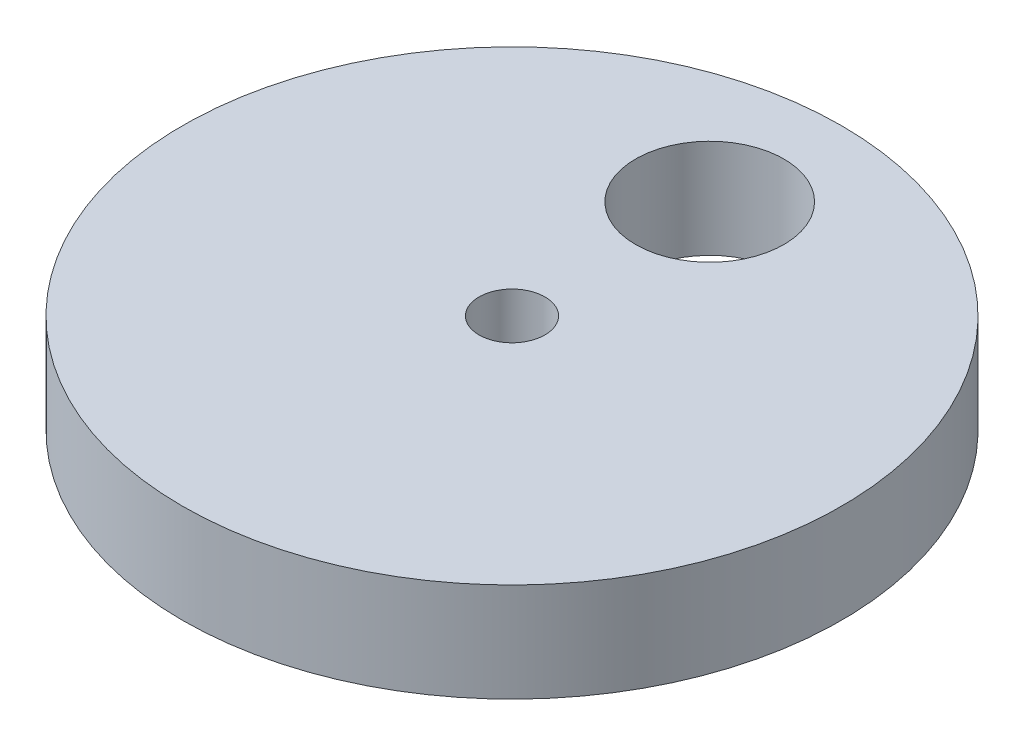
ISO-10303-21;
HEADER;
FILE_DESCRIPTION(('STEP AP214'),'2;1');
FILE_NAME('part.step','',(''),(''),'','','');
FILE_SCHEMA(('AUTOMOTIVE_DESIGN { 1 0 10303 214 1 1 1 1 }'));
ENDSEC;
DATA;
#1=APPLICATION_CONTEXT('core data for automotive mechanical design processes');
#2=APPLICATION_PROTOCOL_DEFINITION('international standard','automotive_design',2000,#1);
#3=PRODUCT_CONTEXT('',#1,'mechanical');
#4=PRODUCT('Part','Part','',(#3));
#5=PRODUCT_RELATED_PRODUCT_CATEGORY('part','',(#4));
#6=PRODUCT_DEFINITION_FORMATION('','',#4);
#7=PRODUCT_DEFINITION_CONTEXT('part definition',#1,'design');
#8=PRODUCT_DEFINITION('design','',#6,#7);
#9=PRODUCT_DEFINITION_SHAPE('','',#8);
#10=(LENGTH_UNIT() NAMED_UNIT(*) SI_UNIT(.MILLI.,.METRE.));
#11=(NAMED_UNIT(*) PLANE_ANGLE_UNIT() SI_UNIT($,.RADIAN.));
#12=(NAMED_UNIT(*) SI_UNIT($,.STERADIAN.) SOLID_ANGLE_UNIT());
#13=UNCERTAINTY_MEASURE_WITH_UNIT(LENGTH_MEASURE(1.E-05),#10,'distance_accuracy_value','');
#14=(GEOMETRIC_REPRESENTATION_CONTEXT(3) GLOBAL_UNCERTAINTY_ASSIGNED_CONTEXT((#13)) GLOBAL_UNIT_ASSIGNED_CONTEXT((#10,
#11,#12)) REPRESENTATION_CONTEXT('',''));
#15=CARTESIAN_POINT('',(0.,0.,0.));
#16=DIRECTION('',(0.,0.,1.));
#17=DIRECTION('',(1.,0.,0.));
#18=AXIS2_PLACEMENT_3D('',#15,#16,#17);
#19=CARTESIAN_POINT('',(0.,3.,0.));
#20=DIRECTION('',(0.,1.,0.));
#21=DIRECTION('',(0.,0.,1.));
#22=AXIS2_PLACEMENT_3D('',#19,#20,#21);
#23=PLANE('',#22);
#24=CARTESIAN_POINT('',(0.,3.,0.));
#25=DIRECTION('',(0.,1.,0.));
#26=DIRECTION('',(0.,0.,1.));
#27=AXIS2_PLACEMENT_3D('',#24,#25,#26);
#28=CIRCLE('',#27,1.);
#29=CARTESIAN_POINT('',(0.,3.,1.));
#30=VERTEX_POINT('',#29);
#31=EDGE_CURVE('E43',#30,#30,#28,.T.);
#32=ORIENTED_EDGE('',*,*,#31,.F.);
#33=EDGE_LOOP('',(#32));
#34=FACE_BOUND('',#33,.T.);
#35=CARTESIAN_POINT('',(0.,3.,0.));
#36=DIRECTION('',(0.,1.,0.));
#37=DIRECTION('',(0.,0.,1.));
#38=AXIS2_PLACEMENT_3D('',#35,#36,#37);
#39=CIRCLE('',#38,10.);
#40=CARTESIAN_POINT('',(0.,3.,10.));
#41=VERTEX_POINT('',#40);
#42=EDGE_CURVE('E10',#41,#41,#39,.T.);
#43=ORIENTED_EDGE('',*,*,#42,.T.);
#44=EDGE_LOOP('',(#43));
#45=FACE_BOUND('',#44,.T.);
#46=CARTESIAN_POINT('',(0.,3.,-6.));
#47=DIRECTION('',(0.,1.,0.));
#48=DIRECTION('',(0.,0.,1.));
#49=AXIS2_PLACEMENT_3D('',#46,#47,#48);
#50=CIRCLE('',#49,2.25);
#51=CARTESIAN_POINT('',(0.,3.,-3.75));
#52=VERTEX_POINT('',#51);
#53=EDGE_CURVE('E48',#52,#52,#50,.T.);
#54=ORIENTED_EDGE('',*,*,#53,.F.);
#55=EDGE_LOOP('',(#54));
#56=FACE_BOUND('',#55,.T.);
#57=ADVANCED_FACE('F32',(#34,#45,#56),#23,.T.);
#58=CARTESIAN_POINT('',(0.,0.,0.));
#59=DIRECTION('',(0.,1.,0.));
#60=DIRECTION('',(0.,0.,1.));
#61=AXIS2_PLACEMENT_3D('',#58,#59,#60);
#62=PLANE('',#61);
#63=CARTESIAN_POINT('',(0.,0.,0.));
#64=DIRECTION('',(0.,1.,0.));
#65=DIRECTION('',(0.,0.,1.));
#66=AXIS2_PLACEMENT_3D('',#63,#64,#65);
#67=CIRCLE('',#66,1.);
#68=CARTESIAN_POINT('',(0.,0.,1.));
#69=VERTEX_POINT('',#68);
#70=EDGE_CURVE('E45',#69,#69,#67,.T.);
#71=ORIENTED_EDGE('',*,*,#70,.T.);
#72=EDGE_LOOP('',(#71));
#73=FACE_BOUND('',#72,.T.);
#74=CARTESIAN_POINT('',(0.,0.,0.));
#75=DIRECTION('',(0.,1.,0.));
#76=DIRECTION('',(0.,0.,1.));
#77=AXIS2_PLACEMENT_3D('',#74,#75,#76);
#78=CIRCLE('',#77,10.);
#79=CARTESIAN_POINT('',(0.,0.,10.));
#80=VERTEX_POINT('',#79);
#81=EDGE_CURVE('E36',#80,#80,#78,.T.);
#82=ORIENTED_EDGE('',*,*,#81,.F.);
#83=EDGE_LOOP('',(#82));
#84=FACE_BOUND('',#83,.T.);
#85=CARTESIAN_POINT('',(0.,0.,-6.));
#86=DIRECTION('',(0.,1.,0.));
#87=DIRECTION('',(0.,0.,1.));
#88=AXIS2_PLACEMENT_3D('',#85,#86,#87);
#89=CIRCLE('',#88,2.25);
#90=CARTESIAN_POINT('',(0.,0.,-3.75));
#91=VERTEX_POINT('',#90);
#92=EDGE_CURVE('E51',#91,#91,#89,.T.);
#93=ORIENTED_EDGE('',*,*,#92,.T.);
#94=EDGE_LOOP('',(#93));
#95=FACE_BOUND('',#94,.T.);
#96=ADVANCED_FACE('F61',(#73,#84,#95),#62,.F.);
#97=CARTESIAN_POINT('',(0.,3.,0.));
#98=DIRECTION('',(0.,-1.,0.));
#99=DIRECTION('',(0.,0.,-1.));
#100=AXIS2_PLACEMENT_3D('',#97,#98,#99);
#101=CYLINDRICAL_SURFACE('',#100,10.);
#102=ORIENTED_EDGE('',*,*,#42,.F.);
#103=EDGE_LOOP('',(#102));
#104=FACE_BOUND('',#103,.T.);
#105=ORIENTED_EDGE('',*,*,#81,.T.);
#106=EDGE_LOOP('',(#105));
#107=FACE_BOUND('',#106,.T.);
#108=ADVANCED_FACE('F34',(#104,#107),#101,.T.);
#109=CARTESIAN_POINT('',(0.,3.,0.));
#110=DIRECTION('',(0.,-1.,0.));
#111=DIRECTION('',(0.,0.,-1.));
#112=AXIS2_PLACEMENT_3D('',#109,#110,#111);
#113=CYLINDRICAL_SURFACE('',#112,1.);
#114=ORIENTED_EDGE('',*,*,#31,.T.);
#115=EDGE_LOOP('',(#114));
#116=FACE_BOUND('',#115,.T.);
#117=ORIENTED_EDGE('',*,*,#70,.F.);
#118=EDGE_LOOP('',(#117));
#119=FACE_BOUND('',#118,.T.);
#120=ADVANCED_FACE('F70',(#116,#119),#113,.F.);
#121=CARTESIAN_POINT('',(0.,3.,-6.));
#122=DIRECTION('',(0.,-1.,0.));
#123=DIRECTION('',(0.,0.,-1.));
#124=AXIS2_PLACEMENT_3D('',#121,#122,#123);
#125=CYLINDRICAL_SURFACE('',#124,2.25);
#126=ORIENTED_EDGE('',*,*,#53,.T.);
#127=EDGE_LOOP('',(#126));
#128=FACE_BOUND('',#127,.T.);
#129=ORIENTED_EDGE('',*,*,#92,.F.);
#130=EDGE_LOOP('',(#129));
#131=FACE_BOUND('',#130,.T.);
#132=ADVANCED_FACE('F57',(#128,#131),#125,.F.);
#133=CLOSED_SHELL('',(#57,#96,#108,#120,#132));
#134=MANIFOLD_SOLID_BREP('B2',#133);
#135=ADVANCED_BREP_SHAPE_REPRESENTATION('',(#18,#134),#14);
#136=SHAPE_DEFINITION_REPRESENTATION(#9,#135);
ENDSEC;
END-ISO-10303-21;
